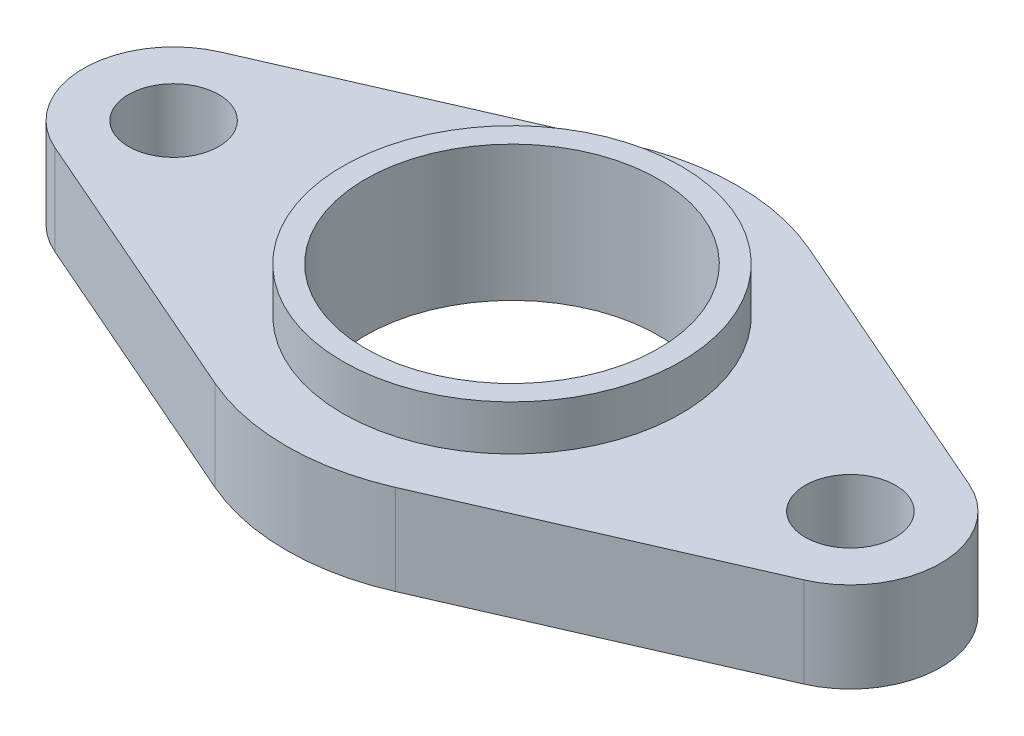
from build123d import *

# Parameters (mm, degrees)
SKETCH1_R      = 37.5
SKETCH1_R_2    = 10
EXTRUDE1_DEPTH = 20
SKETCH1_3_R    = 37.5
SKETCH1_3_R_2  = 32.5
EXTRUDE2_DEPTH = 30


with BuildPart() as part:
    # Sketch1 → Extrude1 (new body)
    with BuildSketch(Plane(origin=(0, 0, 0), x_dir=(1, 0, 0), z_dir=(0, 1, 0))):
        with BuildLine():
            Line((-83, -18.33030278), (-20, -45.82575695))
            ThreePointArc((-20, -45.82575695), (0, -50), (20, -45.82575695))
            Line((20, -45.82575695), (83, -18.33030278))
            ThreePointArc((83, -18.33030278), (95, 0), (83, 18.33030278))
            Line((83, 18.33030278), (20, 45.82575695))
            ThreePointArc((20, 45.82575695), (0, 50), (-20, 45.82575695))
            Line((-20, 45.82575695), (-83, 18.33030278))
            ThreePointArc((-83, 18.33030278), (-95, 0), (-83, -18.33030278))
        make_face()
        with Locations(Location((0, 0, 0), (0, 0, 270))):
            Circle(SKETCH1_R, mode=Mode.SUBTRACT)
        with Locations(Location((75, 0, 0), (0, 0, 270))):
            Circle(SKETCH1_R_2, mode=Mode.SUBTRACT)
        with Locations(Location((-75, 0, 0), (0, 0, 270))):
            Circle(SKETCH1_R_2, mode=Mode.SUBTRACT)
    extrude(amount=EXTRUDE1_DEPTH)

    # Sketch1_3 → Extrude2 (add)
    with BuildSketch(Plane(origin=(0, 0, 0), x_dir=(1, 0, 0), z_dir=(0, 1, 0))):
        with Locations(Location((0, 0, 0), (0, 0, 270))):
            Circle(SKETCH1_3_R)
        with Locations(Location((0, 0, 0), (0, 0, 270))):
            Circle(SKETCH1_3_R_2, mode=Mode.SUBTRACT)
    extrude(amount=EXTRUDE2_DEPTH)


solid = part.part
